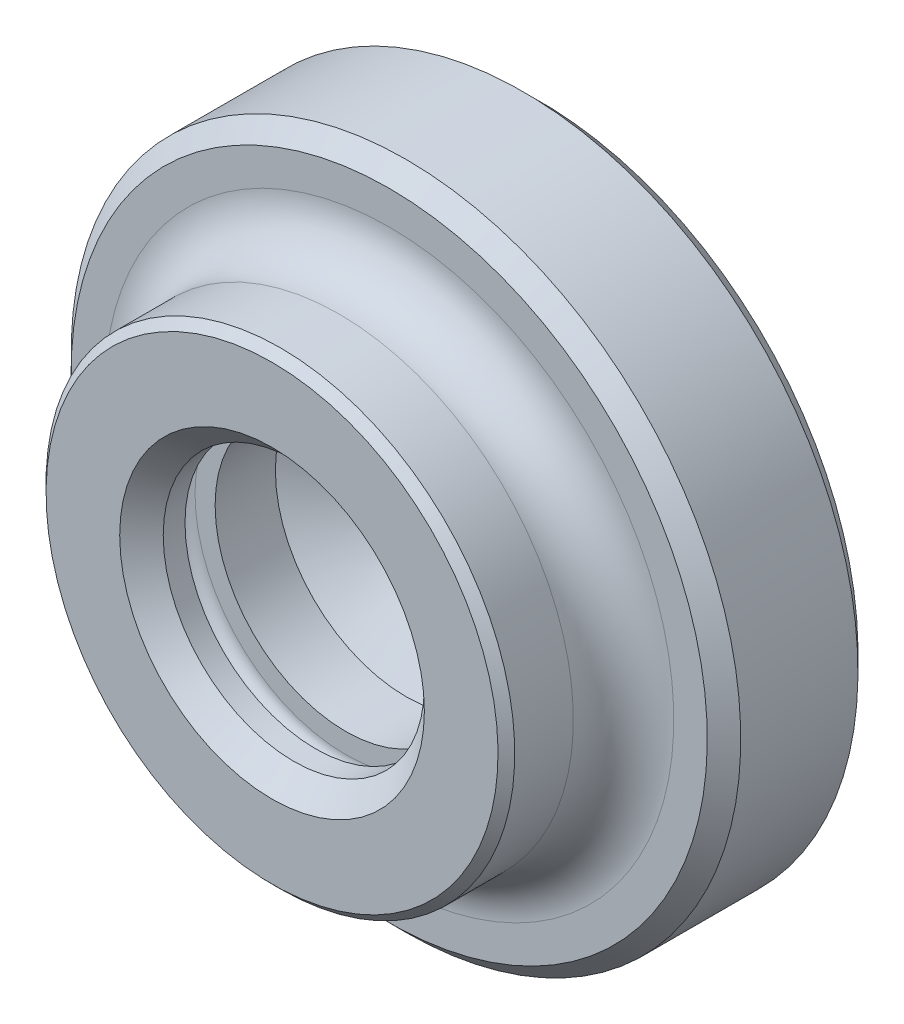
ISO-10303-21;
HEADER;
FILE_DESCRIPTION(('STEP AP214'),'2;1');
FILE_NAME('part.step','',(''),(''),'','','');
FILE_SCHEMA(('AUTOMOTIVE_DESIGN { 1 0 10303 214 1 1 1 1 }'));
ENDSEC;
DATA;
#1=APPLICATION_CONTEXT('core data for automotive mechanical design processes');
#2=APPLICATION_PROTOCOL_DEFINITION('international standard','automotive_design',2000,#1);
#3=PRODUCT_CONTEXT('',#1,'mechanical');
#4=PRODUCT('Part','Part','',(#3));
#5=PRODUCT_RELATED_PRODUCT_CATEGORY('part','',(#4));
#6=PRODUCT_DEFINITION_FORMATION('','',#4);
#7=PRODUCT_DEFINITION_CONTEXT('part definition',#1,'design');
#8=PRODUCT_DEFINITION('design','',#6,#7);
#9=PRODUCT_DEFINITION_SHAPE('','',#8);
#10=(LENGTH_UNIT() NAMED_UNIT(*) SI_UNIT(.MILLI.,.METRE.));
#11=(NAMED_UNIT(*) PLANE_ANGLE_UNIT() SI_UNIT($,.RADIAN.));
#12=(NAMED_UNIT(*) SI_UNIT($,.STERADIAN.) SOLID_ANGLE_UNIT());
#13=UNCERTAINTY_MEASURE_WITH_UNIT(LENGTH_MEASURE(1.E-05),#10,'distance_accuracy_value','');
#14=(GEOMETRIC_REPRESENTATION_CONTEXT(3) GLOBAL_UNCERTAINTY_ASSIGNED_CONTEXT((#13)) GLOBAL_UNIT_ASSIGNED_CONTEXT((#10,
#11,#12)) REPRESENTATION_CONTEXT('',''));
#15=CARTESIAN_POINT('',(0.,0.,0.));
#16=DIRECTION('',(0.,0.,1.));
#17=DIRECTION('',(1.,0.,0.));
#18=AXIS2_PLACEMENT_3D('',#15,#16,#17);
#19=CARTESIAN_POINT('',(0.,0.,7.99999999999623));
#20=DIRECTION('',(0.,0.,1.));
#21=DIRECTION('',(0.,-1.,0.));
#22=AXIS2_PLACEMENT_3D('',#19,#20,#21);
#23=CONICAL_SURFACE('',#22,7.80000000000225,1.0297442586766);
#24=CARTESIAN_POINT('',(0.,2.22044604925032E-13,3.31328717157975));
#25=VERTEX_POINT('',#24);
#26=VERTEX_LOOP('',#25);
#27=FACE_BOUND('',#26,.T.);
#28=CARTESIAN_POINT('',(0.,0.,8.));
#29=DIRECTION('',(0.,0.,1.));
#30=DIRECTION('',(0.,-1.,0.));
#31=AXIS2_PLACEMENT_3D('',#28,#29,#30);
#32=CIRCLE('',#31,7.8);
#33=CARTESIAN_POINT('',(0.,-7.8,8.));
#34=VERTEX_POINT('',#33);
#35=EDGE_CURVE('E30',#34,#34,#32,.T.);
#36=ORIENTED_EDGE('',*,*,#35,.T.);
#37=EDGE_LOOP('',(#36));
#38=FACE_BOUND('',#37,.T.);
#39=ADVANCED_FACE('F14',(#27,#38),#23,.F.);
#40=CARTESIAN_POINT('',(0.,0.,0.));
#41=DIRECTION('',(0.,0.,1.));
#42=DIRECTION('',(0.,-1.,0.));
#43=AXIS2_PLACEMENT_3D('',#40,#41,#42);
#44=CYLINDRICAL_SURFACE('',#43,7.8);
#45=ORIENTED_EDGE('',*,*,#35,.F.);
#46=EDGE_LOOP('',(#45));
#47=FACE_BOUND('',#46,.T.);
#48=CARTESIAN_POINT('',(0.,0.,11.6));
#49=DIRECTION('',(0.,0.,1.));
#50=DIRECTION('',(0.,-1.,0.));
#51=AXIS2_PLACEMENT_3D('',#48,#49,#50);
#52=CIRCLE('',#51,7.8);
#53=CARTESIAN_POINT('',(0.,-7.8,11.6));
#54=VERTEX_POINT('',#53);
#55=EDGE_CURVE('E17',#54,#54,#52,.T.);
#56=ORIENTED_EDGE('',*,*,#55,.T.);
#57=EDGE_LOOP('',(#56));
#58=FACE_BOUND('',#57,.T.);
#59=ADVANCED_FACE('F27',(#47,#58),#44,.F.);
#60=CARTESIAN_POINT('',(7.8,0.,11.6));
#61=DIRECTION('',(0.,0.,-1.));
#62=DIRECTION('',(0.,1.,0.));
#63=AXIS2_PLACEMENT_3D('',#60,#61,#62);
#64=PLANE('',#63);
#65=ORIENTED_EDGE('',*,*,#55,.F.);
#66=EDGE_LOOP('',(#65));
#67=FACE_BOUND('',#66,.T.);
#68=CARTESIAN_POINT('',(0.,0.,11.6));
#69=DIRECTION('',(0.,0.,-1.));
#70=DIRECTION('',(0.,1.,0.));
#71=AXIS2_PLACEMENT_3D('',#68,#69,#70);
#72=CIRCLE('',#71,9.);
#73=CARTESIAN_POINT('',(0.,9.,11.6));
#74=VERTEX_POINT('',#73);
#75=EDGE_CURVE('E34',#74,#74,#72,.F.);
#76=ORIENTED_EDGE('',*,*,#75,.T.);
#77=EDGE_LOOP('',(#76));
#78=FACE_BOUND('',#77,.T.);
#79=ADVANCED_FACE('F79',(#67,#78),#64,.F.);
#80=CARTESIAN_POINT('',(0.,0.,12.5));
#81=DIRECTION('',(0.,0.,-1.));
#82=DIRECTION('',(0.,1.,0.));
#83=AXIS2_PLACEMENT_3D('',#80,#81,#82);
#84=TOROIDAL_SURFACE('',#83,9.,0.9);
#85=ORIENTED_EDGE('',*,*,#75,.F.);
#86=EDGE_LOOP('',(#85));
#87=FACE_BOUND('',#86,.T.);
#88=CARTESIAN_POINT('',(0.,0.,13.4));
#89=DIRECTION('',(0.,0.,1.));
#90=DIRECTION('',(0.,1.,0.));
#91=AXIS2_PLACEMENT_3D('',#88,#89,#90);
#92=CIRCLE('',#91,9.);
#93=CARTESIAN_POINT('',(0.,9.,13.4));
#94=VERTEX_POINT('',#93);
#95=EDGE_CURVE('E66',#94,#94,#92,.T.);
#96=ORIENTED_EDGE('',*,*,#95,.T.);
#97=EDGE_LOOP('',(#96));
#98=FACE_BOUND('',#97,.T.);
#99=ADVANCED_FACE('F95',(#87,#98),#84,.F.);
#100=CARTESIAN_POINT('',(9.,0.,13.4));
#101=DIRECTION('',(0.,0.,1.));
#102=DIRECTION('',(0.,-1.,0.));
#103=AXIS2_PLACEMENT_3D('',#100,#101,#102);
#104=PLANE('',#103);
#105=ORIENTED_EDGE('',*,*,#95,.F.);
#106=EDGE_LOOP('',(#105));
#107=FACE_BOUND('',#106,.T.);
#108=CARTESIAN_POINT('',(0.,0.,13.4));
#109=DIRECTION('',(0.,0.,1.));
#110=DIRECTION('',(0.,-1.,0.));
#111=AXIS2_PLACEMENT_3D('',#108,#109,#110);
#112=CIRCLE('',#111,7.8);
#113=CARTESIAN_POINT('',(0.,-7.8,13.4));
#114=VERTEX_POINT('',#113);
#115=EDGE_CURVE('E64',#114,#114,#112,.T.);
#116=ORIENTED_EDGE('',*,*,#115,.T.);
#117=EDGE_LOOP('',(#116));
#118=FACE_BOUND('',#117,.T.);
#119=ADVANCED_FACE('F174',(#107,#118),#104,.F.);
#120=CARTESIAN_POINT('',(0.,0.,0.));
#121=DIRECTION('',(0.,0.,1.));
#122=DIRECTION('',(0.,-1.,0.));
#123=AXIS2_PLACEMENT_3D('',#120,#121,#122);
#124=CYLINDRICAL_SURFACE('',#123,7.8);
#125=ORIENTED_EDGE('',*,*,#115,.F.);
#126=EDGE_LOOP('',(#125));
#127=FACE_BOUND('',#126,.T.);
#128=CARTESIAN_POINT('',(0.,0.,14.7));
#129=DIRECTION('',(0.,0.,1.));
#130=DIRECTION('',(0.,-1.,0.));
#131=AXIS2_PLACEMENT_3D('',#128,#129,#130);
#132=CIRCLE('',#131,7.8);
#133=CARTESIAN_POINT('',(0.,-7.8,14.7));
#134=VERTEX_POINT('',#133);
#135=EDGE_CURVE('E63',#134,#134,#132,.T.);
#136=ORIENTED_EDGE('',*,*,#135,.T.);
#137=EDGE_LOOP('',(#136));
#138=FACE_BOUND('',#137,.T.);
#139=ADVANCED_FACE('F183',(#127,#138),#124,.F.);
#140=CARTESIAN_POINT('',(0.,0.,16.));
#141=DIRECTION('',(0.,0.,1.));
#142=DIRECTION('',(0.,-1.,0.));
#143=AXIS2_PLACEMENT_3D('',#140,#141,#142);
#144=CONICAL_SURFACE('',#143,9.1,0.785398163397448);
#145=ORIENTED_EDGE('',*,*,#135,.F.);
#146=EDGE_LOOP('',(#145));
#147=FACE_BOUND('',#146,.T.);
#148=CARTESIAN_POINT('',(0.,0.,16.));
#149=DIRECTION('',(0.,0.,1.));
#150=DIRECTION('',(0.,-1.,0.));
#151=AXIS2_PLACEMENT_3D('',#148,#149,#150);
#152=CIRCLE('',#151,9.1);
#153=CARTESIAN_POINT('',(0.,-9.1,16.));
#154=VERTEX_POINT('',#153);
#155=EDGE_CURVE('E61',#154,#154,#152,.T.);
#156=ORIENTED_EDGE('',*,*,#155,.T.);
#157=EDGE_LOOP('',(#156));
#158=FACE_BOUND('',#157,.T.);
#159=ADVANCED_FACE('F186',(#147,#158),#144,.F.);
#160=CARTESIAN_POINT('',(9.1,0.,16.));
#161=DIRECTION('',(0.,0.,-1.));
#162=DIRECTION('',(0.,1.,0.));
#163=AXIS2_PLACEMENT_3D('',#160,#161,#162);
#164=PLANE('',#163);
#165=ORIENTED_EDGE('',*,*,#155,.F.);
#166=EDGE_LOOP('',(#165));
#167=FACE_BOUND('',#166,.T.);
#168=CARTESIAN_POINT('',(0.,0.,16.));
#169=DIRECTION('',(0.,0.,-1.));
#170=DIRECTION('',(0.,1.,0.));
#171=AXIS2_PLACEMENT_3D('',#168,#169,#170);
#172=CIRCLE('',#171,13.5);
#173=CARTESIAN_POINT('',(0.,13.5,16.));
#174=VERTEX_POINT('',#173);
#175=EDGE_CURVE('E58',#174,#174,#172,.T.);
#176=ORIENTED_EDGE('',*,*,#175,.F.);
#177=EDGE_LOOP('',(#176));
#178=FACE_BOUND('',#177,.T.);
#179=ADVANCED_FACE('F190',(#167,#178),#164,.F.);
#180=CARTESIAN_POINT('',(0.,0.,15.5));
#181=DIRECTION('',(0.,0.,-1.));
#182=DIRECTION('',(0.,1.,0.));
#183=AXIS2_PLACEMENT_3D('',#180,#181,#182);
#184=CONICAL_SURFACE('',#183,14.,0.785398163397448);
#185=ORIENTED_EDGE('',*,*,#175,.T.);
#186=EDGE_LOOP('',(#185));
#187=FACE_BOUND('',#186,.T.);
#188=CARTESIAN_POINT('',(0.,0.,15.5));
#189=DIRECTION('',(0.,0.,1.));
#190=DIRECTION('',(0.,-1.,0.));
#191=AXIS2_PLACEMENT_3D('',#188,#189,#190);
#192=CIRCLE('',#191,14.);
#193=CARTESIAN_POINT('',(0.,-14.,15.5));
#194=VERTEX_POINT('',#193);
#195=EDGE_CURVE('E57',#194,#194,#192,.F.);
#196=ORIENTED_EDGE('',*,*,#195,.F.);
#197=EDGE_LOOP('',(#196));
#198=FACE_BOUND('',#197,.T.);
#199=ADVANCED_FACE('F194',(#187,#198),#184,.T.);
#200=CARTESIAN_POINT('',(0.,0.,1.));
#201=DIRECTION('',(0.,0.,-1.));
#202=DIRECTION('',(0.,1.,0.));
#203=AXIS2_PLACEMENT_3D('',#200,#201,#202);
#204=PLANE('',#203);
#205=CARTESIAN_POINT('',(0.,0.,1.));
#206=DIRECTION('',(0.,0.,1.));
#207=DIRECTION('',(0.,-1.,0.));
#208=AXIS2_PLACEMENT_3D('',#205,#206,#207);
#209=CIRCLE('',#208,9.);
#210=CARTESIAN_POINT('',(0.,-9.,1.));
#211=VERTEX_POINT('',#210);
#212=EDGE_CURVE('E54',#211,#211,#209,.F.);
#213=ORIENTED_EDGE('',*,*,#212,.T.);
#214=EDGE_LOOP('',(#213));
#215=FACE_BOUND('',#214,.T.);
#216=ADVANCED_FACE('F198',(#215),#204,.T.);
#217=CARTESIAN_POINT('',(0.,0.,0.));
#218=DIRECTION('',(0.,0.,1.));
#219=DIRECTION('',(0.,-1.,0.));
#220=AXIS2_PLACEMENT_3D('',#217,#218,#219);
#221=CYLINDRICAL_SURFACE('',#220,14.);
#222=ORIENTED_EDGE('',*,*,#195,.T.);
#223=EDGE_LOOP('',(#222));
#224=FACE_BOUND('',#223,.T.);
#225=CARTESIAN_POINT('',(0.,0.,12.));
#226=DIRECTION('',(0.,0.,-1.));
#227=DIRECTION('',(0.,1.,0.));
#228=AXIS2_PLACEMENT_3D('',#225,#226,#227);
#229=CIRCLE('',#228,14.);
#230=CARTESIAN_POINT('',(0.,14.,12.));
#231=VERTEX_POINT('',#230);
#232=EDGE_CURVE('E53',#231,#231,#229,.F.);
#233=ORIENTED_EDGE('',*,*,#232,.T.);
#234=EDGE_LOOP('',(#233));
#235=FACE_BOUND('',#234,.T.);
#236=ADVANCED_FACE('F201',(#224,#235),#221,.T.);
#237=CARTESIAN_POINT('',(0.,0.,0.));
#238=DIRECTION('',(0.,0.,1.));
#239=DIRECTION('',(0.,-1.,0.));
#240=AXIS2_PLACEMENT_3D('',#237,#238,#239);
#241=CYLINDRICAL_SURFACE('',#240,9.);
#242=ORIENTED_EDGE('',*,*,#212,.F.);
#243=EDGE_LOOP('',(#242));
#244=FACE_BOUND('',#243,.T.);
#245=CARTESIAN_POINT('',(0.,0.,0.));
#246=DIRECTION('',(0.,0.,1.));
#247=DIRECTION('',(0.,-1.,0.));
#248=AXIS2_PLACEMENT_3D('',#245,#246,#247);
#249=CIRCLE('',#248,9.);
#250=CARTESIAN_POINT('',(0.,-9.,0.));
#251=VERTEX_POINT('',#250);
#252=EDGE_CURVE('E50',#251,#251,#249,.F.);
#253=ORIENTED_EDGE('',*,*,#252,.T.);
#254=EDGE_LOOP('',(#253));
#255=FACE_BOUND('',#254,.T.);
#256=ADVANCED_FACE('F149',(#244,#255),#241,.F.);
#257=CARTESIAN_POINT('',(0.,0.,12.));
#258=DIRECTION('',(0.,0.,-1.));
#259=DIRECTION('',(0.,1.,0.));
#260=AXIS2_PLACEMENT_3D('',#257,#258,#259);
#261=TOROIDAL_SURFACE('',#260,17.,3.);
#262=ORIENTED_EDGE('',*,*,#232,.F.);
#263=EDGE_LOOP('',(#262));
#264=FACE_BOUND('',#263,.T.);
#265=CARTESIAN_POINT('',(0.,0.,9.));
#266=DIRECTION('',(0.,0.,1.));
#267=DIRECTION('',(0.,1.,0.));
#268=AXIS2_PLACEMENT_3D('',#265,#266,#267);
#269=CIRCLE('',#268,17.);
#270=CARTESIAN_POINT('',(0.,17.,9.));
#271=VERTEX_POINT('',#270);
#272=EDGE_CURVE('E49',#271,#271,#269,.T.);
#273=ORIENTED_EDGE('',*,*,#272,.T.);
#274=EDGE_LOOP('',(#273));
#275=FACE_BOUND('',#274,.T.);
#276=ADVANCED_FACE('F145',(#264,#275),#261,.F.);
#277=CARTESIAN_POINT('',(19.,0.,0.));
#278=DIRECTION('',(0.,0.,1.));
#279=DIRECTION('',(0.,-1.,0.));
#280=AXIS2_PLACEMENT_3D('',#277,#278,#279);
#281=PLANE('',#280);
#282=CARTESIAN_POINT('',(0.,0.,0.));
#283=DIRECTION('',(0.,0.,1.));
#284=DIRECTION('',(0.,-1.,0.));
#285=AXIS2_PLACEMENT_3D('',#282,#283,#284);
#286=CIRCLE('',#285,19.);
#287=CARTESIAN_POINT('',(0.,-19.,0.));
#288=VERTEX_POINT('',#287);
#289=EDGE_CURVE('E46',#288,#288,#286,.T.);
#290=ORIENTED_EDGE('',*,*,#289,.F.);
#291=EDGE_LOOP('',(#290));
#292=FACE_BOUND('',#291,.T.);
#293=ORIENTED_EDGE('',*,*,#252,.F.);
#294=EDGE_LOOP('',(#293));
#295=FACE_BOUND('',#294,.T.);
#296=ADVANCED_FACE('F127',(#292,#295),#281,.F.);
#297=CARTESIAN_POINT('',(17.,0.,9.));
#298=DIRECTION('',(0.,0.,-1.));
#299=DIRECTION('',(0.,1.,0.));
#300=AXIS2_PLACEMENT_3D('',#297,#298,#299);
#301=PLANE('',#300);
#302=ORIENTED_EDGE('',*,*,#272,.F.);
#303=EDGE_LOOP('',(#302));
#304=FACE_BOUND('',#303,.T.);
#305=CARTESIAN_POINT('',(0.,0.,9.));
#306=DIRECTION('',(0.,0.,-1.));
#307=DIRECTION('',(0.,1.,0.));
#308=AXIS2_PLACEMENT_3D('',#305,#306,#307);
#309=CIRCLE('',#308,19.);
#310=CARTESIAN_POINT('',(0.,19.,9.));
#311=VERTEX_POINT('',#310);
#312=EDGE_CURVE('E43',#311,#311,#309,.T.);
#313=ORIENTED_EDGE('',*,*,#312,.F.);
#314=EDGE_LOOP('',(#313));
#315=FACE_BOUND('',#314,.T.);
#316=ADVANCED_FACE('F122',(#304,#315),#301,.F.);
#317=CARTESIAN_POINT('',(0.,0.,1.));
#318=DIRECTION('',(0.,0.,1.));
#319=DIRECTION('',(0.,-1.,0.));
#320=AXIS2_PLACEMENT_3D('',#317,#318,#319);
#321=CONICAL_SURFACE('',#320,20.,0.785398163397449);
#322=CARTESIAN_POINT('',(0.,0.,1.));
#323=DIRECTION('',(0.,0.,1.));
#324=DIRECTION('',(0.,-1.,0.));
#325=AXIS2_PLACEMENT_3D('',#322,#323,#324);
#326=CIRCLE('',#325,20.);
#327=CARTESIAN_POINT('',(0.,-20.,1.));
#328=VERTEX_POINT('',#327);
#329=EDGE_CURVE('E21',#328,#328,#326,.T.);
#330=ORIENTED_EDGE('',*,*,#329,.F.);
#331=EDGE_LOOP('',(#330));
#332=FACE_BOUND('',#331,.T.);
#333=ORIENTED_EDGE('',*,*,#289,.T.);
#334=EDGE_LOOP('',(#333));
#335=FACE_BOUND('',#334,.T.);
#336=ADVANCED_FACE('F115',(#332,#335),#321,.T.);
#337=CARTESIAN_POINT('',(0.,0.,8.));
#338=DIRECTION('',(0.,0.,-1.));
#339=DIRECTION('',(0.,1.,0.));
#340=AXIS2_PLACEMENT_3D('',#337,#338,#339);
#341=CONICAL_SURFACE('',#340,20.,0.785398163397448);
#342=ORIENTED_EDGE('',*,*,#312,.T.);
#343=EDGE_LOOP('',(#342));
#344=FACE_BOUND('',#343,.T.);
#345=CARTESIAN_POINT('',(0.,0.,8.));
#346=DIRECTION('',(0.,0.,1.));
#347=DIRECTION('',(0.,-1.,0.));
#348=AXIS2_PLACEMENT_3D('',#345,#346,#347);
#349=CIRCLE('',#348,20.);
#350=CARTESIAN_POINT('',(0.,-20.,8.));
#351=VERTEX_POINT('',#350);
#352=EDGE_CURVE('E9',#351,#351,#349,.F.);
#353=ORIENTED_EDGE('',*,*,#352,.F.);
#354=EDGE_LOOP('',(#353));
#355=FACE_BOUND('',#354,.T.);
#356=ADVANCED_FACE('F108',(#344,#355),#341,.T.);
#357=CARTESIAN_POINT('',(0.,0.,0.));
#358=DIRECTION('',(0.,0.,1.));
#359=DIRECTION('',(0.,-1.,0.));
#360=AXIS2_PLACEMENT_3D('',#357,#358,#359);
#361=CYLINDRICAL_SURFACE('',#360,20.);
#362=ORIENTED_EDGE('',*,*,#352,.T.);
#363=EDGE_LOOP('',(#362));
#364=FACE_BOUND('',#363,.T.);
#365=ORIENTED_EDGE('',*,*,#329,.T.);
#366=EDGE_LOOP('',(#365));
#367=FACE_BOUND('',#366,.T.);
#368=ADVANCED_FACE('F106',(#364,#367),#361,.T.);
#369=CLOSED_SHELL('',(#39,#59,#79,#99,#119,#139,#159,#179,#199,#216,#236,#256,#276,#296,#316,
#336,#356,#368));
#370=MANIFOLD_SOLID_BREP('B1',#369);
#371=ADVANCED_BREP_SHAPE_REPRESENTATION('',(#18,#370),#14);
#372=SHAPE_DEFINITION_REPRESENTATION(#9,#371);
ENDSEC;
END-ISO-10303-21;
